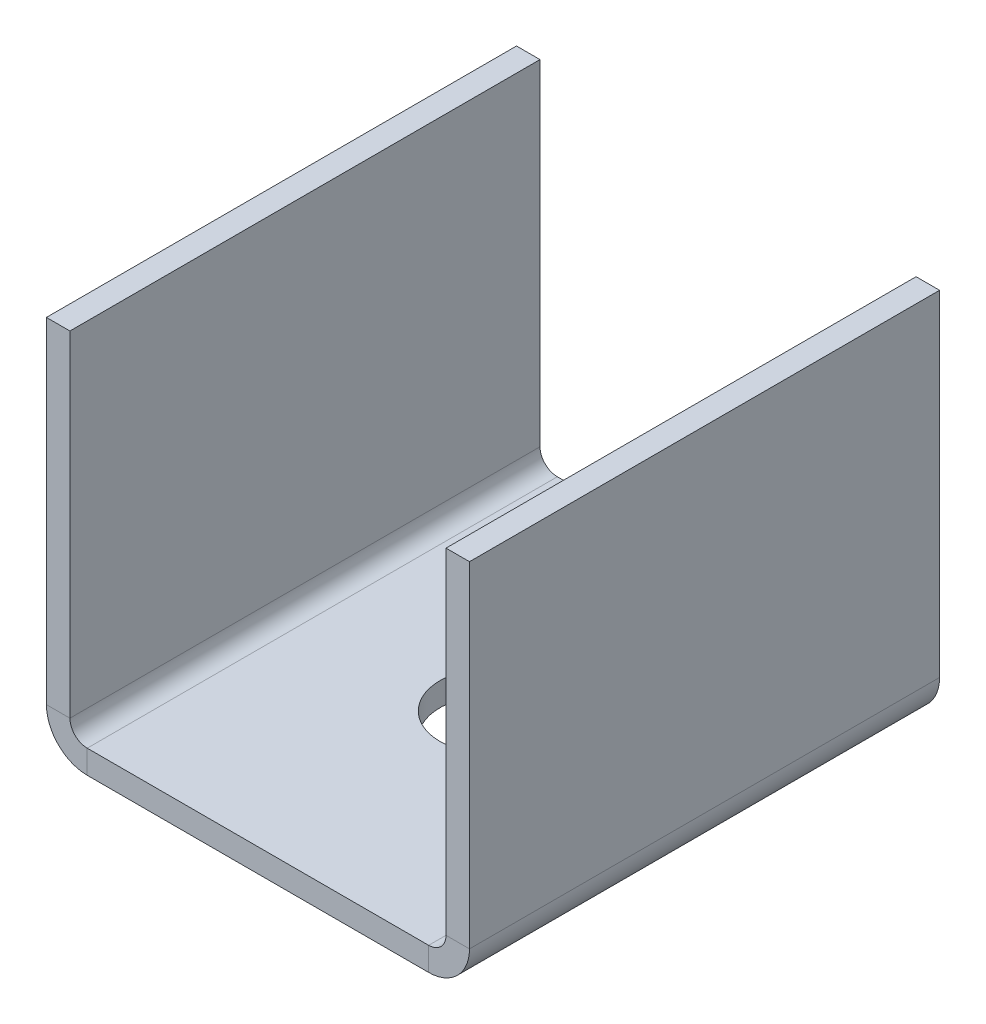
ISO-10303-21;
HEADER;
FILE_DESCRIPTION(('STEP AP214'),'2;1');
FILE_NAME('part.step','',(''),(''),'','','');
FILE_SCHEMA(('AUTOMOTIVE_DESIGN { 1 0 10303 214 1 1 1 1 }'));
ENDSEC;
DATA;
#1=APPLICATION_CONTEXT('core data for automotive mechanical design processes');
#2=APPLICATION_PROTOCOL_DEFINITION('international standard','automotive_design',2000,#1);
#3=PRODUCT_CONTEXT('',#1,'mechanical');
#4=PRODUCT('Part','Part','',(#3));
#5=PRODUCT_RELATED_PRODUCT_CATEGORY('part','',(#4));
#6=PRODUCT_DEFINITION_FORMATION('','',#4);
#7=PRODUCT_DEFINITION_CONTEXT('part definition',#1,'design');
#8=PRODUCT_DEFINITION('design','',#6,#7);
#9=PRODUCT_DEFINITION_SHAPE('','',#8);
#10=(LENGTH_UNIT() NAMED_UNIT(*) SI_UNIT(.MILLI.,.METRE.));
#11=(NAMED_UNIT(*) PLANE_ANGLE_UNIT() SI_UNIT($,.RADIAN.));
#12=(NAMED_UNIT(*) SI_UNIT($,.STERADIAN.) SOLID_ANGLE_UNIT());
#13=UNCERTAINTY_MEASURE_WITH_UNIT(LENGTH_MEASURE(1.E-05),#10,'distance_accuracy_value','');
#14=(GEOMETRIC_REPRESENTATION_CONTEXT(3) GLOBAL_UNCERTAINTY_ASSIGNED_CONTEXT((#13)) GLOBAL_UNIT_ASSIGNED_CONTEXT((#10,
#11,#12)) REPRESENTATION_CONTEXT('',''));
#15=CARTESIAN_POINT('',(0.,0.,0.));
#16=DIRECTION('',(0.,0.,1.));
#17=DIRECTION('',(1.,0.,0.));
#18=AXIS2_PLACEMENT_3D('',#15,#16,#17);
#19=CARTESIAN_POINT('',(33.0000000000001,-31.5268,-20.));
#20=DIRECTION('',(1.,0.,0.));
#21=DIRECTION('',(0.,0.,-1.));
#22=AXIS2_PLACEMENT_3D('',#19,#20,#21);
#23=PLANE('',#22);
#24=DIRECTION('',(0.,0.,1.));
#25=VECTOR('',#24,1.);
#26=CARTESIAN_POINT('',(32.9999999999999,16.0031999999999,-20.));
#27=LINE('',#26,#25);
#28=CARTESIAN_POINT('',(32.9999999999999,16.0031999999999,-20.));
#29=VERTEX_POINT('',#28);
#30=CARTESIAN_POINT('',(32.9999999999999,16.0031999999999,0.));
#31=VERTEX_POINT('',#30);
#32=EDGE_CURVE('E129',#29,#31,#27,.T.);
#33=ORIENTED_EDGE('',*,*,#32,.F.);
#34=DIRECTION('',(0.,-1.,0.));
#35=VECTOR('',#34,1.);
#36=CARTESIAN_POINT('',(33.0000000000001,-31.5268,-20.));
#37=LINE('',#36,#35);
#38=CARTESIAN_POINT('',(33.0000000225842,1.7366,-20.));
#39=VERTEX_POINT('',#38);
#40=EDGE_CURVE('E149',#29,#39,#37,.T.);
#41=ORIENTED_EDGE('',*,*,#40,.T.);
#42=DIRECTION('',(0.,0.,-1.));
#43=VECTOR('',#42,1.);
#44=CARTESIAN_POINT('',(33.,1.7366,-20.));
#45=LINE('',#44,#43);
#46=CARTESIAN_POINT('',(33.,1.7366,0.));
#47=VERTEX_POINT('',#46);
#48=EDGE_CURVE('E148',#47,#39,#45,.T.);
#49=ORIENTED_EDGE('',*,*,#48,.F.);
#50=DIRECTION('',(0.,1.,0.));
#51=VECTOR('',#50,1.);
#52=CARTESIAN_POINT('',(33.0000000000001,-31.5268,0.));
#53=LINE('',#52,#51);
#54=EDGE_CURVE('E143',#47,#31,#53,.T.);
#55=ORIENTED_EDGE('',*,*,#54,.T.);
#56=EDGE_LOOP('',(#33,#41,#49,#55));
#57=FACE_BOUND('',#56,.T.);
#58=ADVANCED_FACE('F40',(#57),#23,.F.);
#59=CARTESIAN_POINT('',(33.0000000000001,-31.5268,0.));
#60=DIRECTION('',(0.,0.,-1.));
#61=DIRECTION('',(0.,-1.,0.));
#62=AXIS2_PLACEMENT_3D('',#59,#60,#61);
#63=PLANE('',#62);
#64=DIRECTION('',(1.,0.,0.));
#65=VECTOR('',#64,1.);
#66=CARTESIAN_POINT('',(32.9999999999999,16.0031999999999,0.));
#67=LINE('',#66,#65);
#68=CARTESIAN_POINT('',(34.,16.0031999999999,0.));
#69=VERTEX_POINT('',#68);
#70=EDGE_CURVE('E132',#31,#69,#67,.T.);
#71=ORIENTED_EDGE('',*,*,#70,.F.);
#72=ORIENTED_EDGE('',*,*,#54,.F.);
#73=DIRECTION('',(-1.,0.,0.));
#74=VECTOR('',#73,1.);
#75=CARTESIAN_POINT('',(33.,1.7366,0.));
#76=LINE('',#75,#74);
#77=CARTESIAN_POINT('',(34.,1.73660000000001,0.));
#78=VERTEX_POINT('',#77);
#79=EDGE_CURVE('E150',#78,#47,#76,.T.);
#80=ORIENTED_EDGE('',*,*,#79,.F.);
#81=DIRECTION('',(0.,1.,0.));
#82=VECTOR('',#81,1.);
#83=CARTESIAN_POINT('',(34.0000000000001,-31.5268,0.));
#84=LINE('',#83,#82);
#85=EDGE_CURVE('E145',#78,#69,#84,.T.);
#86=ORIENTED_EDGE('',*,*,#85,.T.);
#87=EDGE_LOOP('',(#71,#72,#80,#86));
#88=FACE_BOUND('',#87,.T.);
#89=ADVANCED_FACE('F141',(#88),#63,.F.);
#90=CARTESIAN_POINT('',(34.0000000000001,-31.5268,-20.));
#91=DIRECTION('',(1.,0.,0.));
#92=DIRECTION('',(0.,0.,-1.));
#93=AXIS2_PLACEMENT_3D('',#90,#91,#92);
#94=PLANE('',#93);
#95=DIRECTION('',(0.,-1.,0.));
#96=VECTOR('',#95,1.);
#97=CARTESIAN_POINT('',(34.0000000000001,-31.5268,-20.));
#98=LINE('',#97,#96);
#99=CARTESIAN_POINT('',(34.,16.0031999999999,-20.));
#100=VERTEX_POINT('',#99);
#101=CARTESIAN_POINT('',(34.,1.73660000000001,-20.));
#102=VERTEX_POINT('',#101);
#103=EDGE_CURVE('E167',#100,#102,#98,.T.);
#104=ORIENTED_EDGE('',*,*,#103,.F.);
#105=DIRECTION('',(0.,0.,-1.));
#106=VECTOR('',#105,1.);
#107=CARTESIAN_POINT('',(34.,16.0031999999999,0.));
#108=LINE('',#107,#106);
#109=EDGE_CURVE('E57',#69,#100,#108,.T.);
#110=ORIENTED_EDGE('',*,*,#109,.F.);
#111=ORIENTED_EDGE('',*,*,#85,.F.);
#112=DIRECTION('',(0.,0.,-1.));
#113=VECTOR('',#112,1.);
#114=CARTESIAN_POINT('',(34.,1.73660000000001,-20.));
#115=LINE('',#114,#113);
#116=EDGE_CURVE('E255',#78,#102,#115,.T.);
#117=ORIENTED_EDGE('',*,*,#116,.T.);
#118=EDGE_LOOP('',(#104,#110,#111,#117));
#119=FACE_BOUND('',#118,.T.);
#120=ADVANCED_FACE('F319',(#119),#94,.T.);
#121=CARTESIAN_POINT('',(33.0000000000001,-31.5268,-20.));
#122=DIRECTION('',(0.,0.,1.));
#123=DIRECTION('',(0.,1.,0.));
#124=AXIS2_PLACEMENT_3D('',#121,#122,#123);
#125=PLANE('',#124);
#126=DIRECTION('',(-1.,0.,0.));
#127=VECTOR('',#126,1.);
#128=CARTESIAN_POINT('',(34.,16.0031999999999,-20.));
#129=LINE('',#128,#127);
#130=EDGE_CURVE('E133',#100,#29,#129,.T.);
#131=ORIENTED_EDGE('',*,*,#130,.F.);
#132=ORIENTED_EDGE('',*,*,#103,.T.);
#133=DIRECTION('',(1.,0.,0.));
#134=VECTOR('',#133,1.);
#135=CARTESIAN_POINT('',(33.,1.7366,-20.));
#136=LINE('',#135,#134);
#137=EDGE_CURVE('E153',#39,#102,#136,.T.);
#138=ORIENTED_EDGE('',*,*,#137,.F.);
#139=ORIENTED_EDGE('',*,*,#40,.F.);
#140=EDGE_LOOP('',(#131,#132,#138,#139));
#141=FACE_BOUND('',#140,.T.);
#142=ADVANCED_FACE('F326',(#141),#125,.F.);
#143=CARTESIAN_POINT('',(0.,1.,-20.));
#144=DIRECTION('',(0.,0.,1.));
#145=DIRECTION('',(1.,0.,0.));
#146=AXIS2_PLACEMENT_3D('',#143,#144,#145);
#147=PLANE('',#146);
#148=DIRECTION('',(-1.,0.,0.));
#149=VECTOR('',#148,1.);
#150=CARTESIAN_POINT('',(0.,1.,-20.));
#151=LINE('',#150,#149);
#152=CARTESIAN_POINT('',(32.2634,0.999999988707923,-20.));
#153=VERTEX_POINT('',#152);
#154=CARTESIAN_POINT('',(17.7366,1.,-20.));
#155=VERTEX_POINT('',#154);
#156=EDGE_CURVE('E217',#153,#155,#151,.T.);
#157=ORIENTED_EDGE('',*,*,#156,.F.);
#158=DIRECTION('',(0.,-1.,0.));
#159=VECTOR('',#158,1.);
#160=CARTESIAN_POINT('',(32.2634,1.,-20.));
#161=LINE('',#160,#159);
#162=CARTESIAN_POINT('',(32.2634,0.,-20.));
#163=VERTEX_POINT('',#162);
#164=EDGE_CURVE('E12',#153,#163,#161,.T.);
#165=ORIENTED_EDGE('',*,*,#164,.T.);
#166=DIRECTION('',(-1.,0.,0.));
#167=VECTOR('',#166,1.);
#168=CARTESIAN_POINT('',(0.,0.,-20.));
#169=LINE('',#168,#167);
#170=CARTESIAN_POINT('',(17.7366,0.,-20.));
#171=VERTEX_POINT('',#170);
#172=EDGE_CURVE('E233',#163,#171,#169,.T.);
#173=ORIENTED_EDGE('',*,*,#172,.T.);
#174=DIRECTION('',(0.,-1.,0.));
#175=VECTOR('',#174,1.);
#176=CARTESIAN_POINT('',(17.7366,1.,-20.));
#177=LINE('',#176,#175);
#178=EDGE_CURVE('E216',#155,#171,#177,.T.);
#179=ORIENTED_EDGE('',*,*,#178,.F.);
#180=EDGE_LOOP('',(#157,#165,#173,#179));
#181=FACE_BOUND('',#180,.T.);
#182=ADVANCED_FACE('F42',(#181),#147,.F.);
#183=CARTESIAN_POINT('',(0.,1.,0.));
#184=DIRECTION('',(0.,0.,-1.));
#185=DIRECTION('',(-1.,0.,0.));
#186=AXIS2_PLACEMENT_3D('',#183,#184,#185);
#187=PLANE('',#186);
#188=DIRECTION('',(1.,0.,0.));
#189=VECTOR('',#188,1.);
#190=CARTESIAN_POINT('',(0.,0.,0.));
#191=LINE('',#190,#189);
#192=CARTESIAN_POINT('',(17.7366,0.,0.));
#193=VERTEX_POINT('',#192);
#194=CARTESIAN_POINT('',(32.2634,-2.25841554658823E-08,0.));
#195=VERTEX_POINT('',#194);
#196=EDGE_CURVE('E212',#193,#195,#191,.T.);
#197=ORIENTED_EDGE('',*,*,#196,.T.);
#198=DIRECTION('',(0.,1.,0.));
#199=VECTOR('',#198,1.);
#200=CARTESIAN_POINT('',(32.2634,1.,0.));
#201=LINE('',#200,#199);
#202=CARTESIAN_POINT('',(32.2634,0.999999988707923,0.));
#203=VERTEX_POINT('',#202);
#204=EDGE_CURVE('E229',#195,#203,#201,.T.);
#205=ORIENTED_EDGE('',*,*,#204,.T.);
#206=DIRECTION('',(1.,0.,0.));
#207=VECTOR('',#206,1.);
#208=CARTESIAN_POINT('',(0.,1.,0.));
#209=LINE('',#208,#207);
#210=CARTESIAN_POINT('',(17.7366,1.00000000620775,0.));
#211=VERTEX_POINT('',#210);
#212=EDGE_CURVE('E44',#211,#203,#209,.T.);
#213=ORIENTED_EDGE('',*,*,#212,.F.);
#214=DIRECTION('',(0.,1.,0.));
#215=VECTOR('',#214,1.);
#216=CARTESIAN_POINT('',(17.7366,1.,0.));
#217=LINE('',#216,#215);
#218=EDGE_CURVE('E223',#193,#211,#217,.T.);
#219=ORIENTED_EDGE('',*,*,#218,.F.);
#220=EDGE_LOOP('',(#197,#205,#213,#219));
#221=FACE_BOUND('',#220,.T.);
#222=ADVANCED_FACE('F245',(#221),#187,.F.);
#223=CARTESIAN_POINT('',(0.,1.,-20.));
#224=DIRECTION('',(0.,-1.,0.));
#225=DIRECTION('',(0.,0.,-1.));
#226=AXIS2_PLACEMENT_3D('',#223,#224,#225);
#227=PLANE('',#226);
#228=CARTESIAN_POINT('',(25.,1.,-10.));
#229=DIRECTION('',(0.,1.,0.));
#230=DIRECTION('',(0.,0.,1.));
#231=AXIS2_PLACEMENT_3D('',#228,#229,#230);
#232=CIRCLE('',#231,2.25);
#233=CARTESIAN_POINT('',(25.,1.,-7.75000000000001));
#234=VERTEX_POINT('',#233);
#235=EDGE_CURVE('E209',#234,#234,#232,.T.);
#236=ORIENTED_EDGE('',*,*,#235,.F.);
#237=EDGE_LOOP('',(#236));
#238=FACE_BOUND('',#237,.T.);
#239=ORIENTED_EDGE('',*,*,#212,.T.);
#240=DIRECTION('',(0.,0.,-1.));
#241=VECTOR('',#240,1.);
#242=CARTESIAN_POINT('',(32.2634,1.,-20.));
#243=LINE('',#242,#241);
#244=EDGE_CURVE('E226',#203,#153,#243,.T.);
#245=ORIENTED_EDGE('',*,*,#244,.T.);
#246=ORIENTED_EDGE('',*,*,#156,.T.);
#247=DIRECTION('',(0.,0.,-1.));
#248=VECTOR('',#247,1.);
#249=CARTESIAN_POINT('',(17.7366,1.,-20.));
#250=LINE('',#249,#248);
#251=EDGE_CURVE('E213',#211,#155,#250,.T.);
#252=ORIENTED_EDGE('',*,*,#251,.F.);
#253=EDGE_LOOP('',(#239,#245,#246,#252));
#254=FACE_BOUND('',#253,.T.);
#255=ADVANCED_FACE('F241',(#238,#254),#227,.F.);
#256=CARTESIAN_POINT('',(0.,0.,-20.));
#257=DIRECTION('',(0.,-1.,0.));
#258=DIRECTION('',(0.,0.,-1.));
#259=AXIS2_PLACEMENT_3D('',#256,#257,#258);
#260=PLANE('',#259);
#261=DIRECTION('',(0.,0.,-1.));
#262=VECTOR('',#261,1.);
#263=CARTESIAN_POINT('',(32.2634,0.,-20.));
#264=LINE('',#263,#262);
#265=EDGE_CURVE('E49',#195,#163,#264,.T.);
#266=ORIENTED_EDGE('',*,*,#265,.F.);
#267=ORIENTED_EDGE('',*,*,#196,.F.);
#268=DIRECTION('',(0.,0.,-1.));
#269=VECTOR('',#268,1.);
#270=CARTESIAN_POINT('',(17.7366,0.,-20.));
#271=LINE('',#270,#269);
#272=EDGE_CURVE('E220',#193,#171,#271,.T.);
#273=ORIENTED_EDGE('',*,*,#272,.T.);
#274=ORIENTED_EDGE('',*,*,#172,.F.);
#275=EDGE_LOOP('',(#266,#267,#273,#274));
#276=FACE_BOUND('',#275,.T.);
#277=CARTESIAN_POINT('',(25.,0.,-10.));
#278=DIRECTION('',(0.,1.,0.));
#279=DIRECTION('',(0.,0.,1.));
#280=AXIS2_PLACEMENT_3D('',#277,#278,#279);
#281=CIRCLE('',#280,2.25);
#282=CARTESIAN_POINT('',(25.,0.,-7.75000000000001));
#283=VERTEX_POINT('',#282);
#284=EDGE_CURVE('E206',#283,#283,#281,.T.);
#285=ORIENTED_EDGE('',*,*,#284,.T.);
#286=EDGE_LOOP('',(#285));
#287=FACE_BOUND('',#286,.T.);
#288=ADVANCED_FACE('F295',(#276,#287),#260,.T.);
#289=CARTESIAN_POINT('',(25.,1.,-10.));
#290=DIRECTION('',(0.,-1.,0.));
#291=DIRECTION('',(0.,0.,-1.));
#292=AXIS2_PLACEMENT_3D('',#289,#290,#291);
#293=CYLINDRICAL_SURFACE('',#292,2.25);
#294=ORIENTED_EDGE('',*,*,#235,.T.);
#295=EDGE_LOOP('',(#294));
#296=FACE_BOUND('',#295,.T.);
#297=ORIENTED_EDGE('',*,*,#284,.F.);
#298=EDGE_LOOP('',(#297));
#299=FACE_BOUND('',#298,.T.);
#300=ADVANCED_FACE('F344',(#296,#299),#293,.F.);
#301=CARTESIAN_POINT('',(17.7366,1.7365999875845,0.));
#302=DIRECTION('',(0.,0.,-1.));
#303=DIRECTION('',(-1.,0.,0.));
#304=AXIS2_PLACEMENT_3D('',#301,#302,#303);
#305=PLANE('',#304);
#306=DIRECTION('',(1.,0.,0.));
#307=VECTOR('',#306,1.);
#308=CARTESIAN_POINT('',(17.,1.7366,0.));
#309=LINE('',#308,#307);
#310=CARTESIAN_POINT('',(16.,1.7366,0.));
#311=VERTEX_POINT('',#310);
#312=CARTESIAN_POINT('',(17.0000000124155,1.7366,0.));
#313=VERTEX_POINT('',#312);
#314=EDGE_CURVE('E174',#311,#313,#309,.T.);
#315=ORIENTED_EDGE('',*,*,#314,.F.);
#316=CARTESIAN_POINT('',(17.7366,1.7366,0.));
#317=DIRECTION('',(0.,0.,1.));
#318=DIRECTION('',(1.,0.,0.));
#319=AXIS2_PLACEMENT_3D('',#316,#317,#318);
#320=CIRCLE('',#319,1.7365999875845);
#321=EDGE_CURVE('E177',#311,#193,#320,.T.);
#322=ORIENTED_EDGE('',*,*,#321,.T.);
#323=ORIENTED_EDGE('',*,*,#218,.T.);
#324=CARTESIAN_POINT('',(17.7366,1.7365999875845,0.));
#325=DIRECTION('',(0.,0.,1.));
#326=DIRECTION('',(1.,0.,0.));
#327=AXIS2_PLACEMENT_3D('',#324,#325,#326);
#328=CIRCLE('',#327,0.736599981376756);
#329=EDGE_CURVE('E200',#313,#211,#328,.T.);
#330=ORIENTED_EDGE('',*,*,#329,.F.);
#331=EDGE_LOOP('',(#315,#322,#323,#330));
#332=FACE_BOUND('',#331,.T.);
#333=ADVANCED_FACE('F288',(#332),#305,.F.);
#334=CARTESIAN_POINT('',(17.7366,1.7365999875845,-20.));
#335=DIRECTION('',(0.,0.,1.));
#336=DIRECTION('',(1.,0.,0.));
#337=AXIS2_PLACEMENT_3D('',#334,#335,#336);
#338=PLANE('',#337);
#339=CARTESIAN_POINT('',(17.7366,1.7366,-20.));
#340=DIRECTION('',(0.,0.,1.));
#341=DIRECTION('',(1.,0.,0.));
#342=AXIS2_PLACEMENT_3D('',#339,#340,#341);
#343=CIRCLE('',#342,1.7365999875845);
#344=CARTESIAN_POINT('',(16.,1.7366,-20.));
#345=VERTEX_POINT('',#344);
#346=EDGE_CURVE('E197',#171,#345,#343,.F.);
#347=ORIENTED_EDGE('',*,*,#346,.T.);
#348=DIRECTION('',(-1.,0.,0.));
#349=VECTOR('',#348,1.);
#350=CARTESIAN_POINT('',(17.,1.7366,-20.));
#351=LINE('',#350,#349);
#352=CARTESIAN_POINT('',(17.,1.7366,-20.));
#353=VERTEX_POINT('',#352);
#354=EDGE_CURVE('E183',#353,#345,#351,.T.);
#355=ORIENTED_EDGE('',*,*,#354,.F.);
#356=CARTESIAN_POINT('',(17.7366,1.7365999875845,-20.));
#357=DIRECTION('',(0.,0.,-1.));
#358=DIRECTION('',(-1.,0.,0.));
#359=AXIS2_PLACEMENT_3D('',#356,#357,#358);
#360=CIRCLE('',#359,0.736599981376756);
#361=EDGE_CURVE('E203',#155,#353,#360,.T.);
#362=ORIENTED_EDGE('',*,*,#361,.F.);
#363=ORIENTED_EDGE('',*,*,#178,.T.);
#364=EDGE_LOOP('',(#347,#355,#362,#363));
#365=FACE_BOUND('',#364,.T.);
#366=ADVANCED_FACE('F298',(#365),#338,.F.);
#367=CARTESIAN_POINT('',(17.7366,1.7366,-30.0499376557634));
#368=DIRECTION('',(0.,0.,1.));
#369=DIRECTION('',(1.,0.,0.));
#370=AXIS2_PLACEMENT_3D('',#367,#368,#369);
#371=CYLINDRICAL_SURFACE('',#370,0.736599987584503);
#372=ORIENTED_EDGE('',*,*,#251,.T.);
#373=ORIENTED_EDGE('',*,*,#361,.T.);
#374=DIRECTION('',(0.,0.,-1.));
#375=VECTOR('',#374,1.);
#376=CARTESIAN_POINT('',(17.,1.7366,-20.));
#377=LINE('',#376,#375);
#378=EDGE_CURVE('E189',#313,#353,#377,.T.);
#379=ORIENTED_EDGE('',*,*,#378,.F.);
#380=ORIENTED_EDGE('',*,*,#329,.T.);
#381=EDGE_LOOP('',(#372,#373,#379,#380));
#382=FACE_BOUND('',#381,.T.);
#383=ADVANCED_FACE('F286',(#382),#371,.F.);
#384=CARTESIAN_POINT('',(17.7366,1.7366,-30.0499376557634));
#385=DIRECTION('',(0.,0.,1.));
#386=DIRECTION('',(1.,0.,0.));
#387=AXIS2_PLACEMENT_3D('',#384,#385,#386);
#388=CYLINDRICAL_SURFACE('',#387,1.7365999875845);
#389=ORIENTED_EDGE('',*,*,#272,.F.);
#390=ORIENTED_EDGE('',*,*,#321,.F.);
#391=DIRECTION('',(0.,0.,-1.));
#392=VECTOR('',#391,1.);
#393=CARTESIAN_POINT('',(16.,1.7366,-20.));
#394=LINE('',#393,#392);
#395=EDGE_CURVE('E173',#311,#345,#394,.T.);
#396=ORIENTED_EDGE('',*,*,#395,.T.);
#397=ORIENTED_EDGE('',*,*,#346,.F.);
#398=EDGE_LOOP('',(#389,#390,#396,#397));
#399=FACE_BOUND('',#398,.T.);
#400=ADVANCED_FACE('F292',(#399),#388,.T.);
#401=CARTESIAN_POINT('',(17.0000000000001,18.4732,-20.));
#402=DIRECTION('',(-1.,0.,0.));
#403=DIRECTION('',(0.,0.,-1.));
#404=AXIS2_PLACEMENT_3D('',#401,#402,#403);
#405=PLANE('',#404);
#406=DIRECTION('',(0.,1.,0.));
#407=VECTOR('',#406,1.);
#408=CARTESIAN_POINT('',(17.0000000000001,18.4732,-20.));
#409=LINE('',#408,#407);
#410=CARTESIAN_POINT('',(17.,16.0032,-20.));
#411=VERTEX_POINT('',#410);
#412=EDGE_CURVE('E186',#353,#411,#409,.T.);
#413=ORIENTED_EDGE('',*,*,#412,.T.);
#414=DIRECTION('',(0.,0.,-1.));
#415=VECTOR('',#414,1.);
#416=CARTESIAN_POINT('',(17.,16.0032,-20.));
#417=LINE('',#416,#415);
#418=CARTESIAN_POINT('',(17.,16.0032,0.));
#419=VERTEX_POINT('',#418);
#420=EDGE_CURVE('E264',#419,#411,#417,.T.);
#421=ORIENTED_EDGE('',*,*,#420,.F.);
#422=DIRECTION('',(0.,-1.,0.));
#423=VECTOR('',#422,1.);
#424=CARTESIAN_POINT('',(17.0000000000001,18.4732,0.));
#425=LINE('',#424,#423);
#426=EDGE_CURVE('E191',#419,#313,#425,.T.);
#427=ORIENTED_EDGE('',*,*,#426,.T.);
#428=ORIENTED_EDGE('',*,*,#378,.T.);
#429=EDGE_LOOP('',(#413,#421,#427,#428));
#430=FACE_BOUND('',#429,.T.);
#431=ADVANCED_FACE('F276',(#430),#405,.F.);
#432=CARTESIAN_POINT('',(17.0000000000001,18.4732,-20.));
#433=DIRECTION('',(0.,0.,1.));
#434=DIRECTION('',(0.,-1.,0.));
#435=AXIS2_PLACEMENT_3D('',#432,#433,#434);
#436=PLANE('',#435);
#437=DIRECTION('',(0.,1.,0.));
#438=VECTOR('',#437,1.);
#439=CARTESIAN_POINT('',(16.0000000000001,18.4732,-20.));
#440=LINE('',#439,#438);
#441=CARTESIAN_POINT('',(16.,16.0032,-20.));
#442=VERTEX_POINT('',#441);
#443=EDGE_CURVE('E180',#345,#442,#440,.T.);
#444=ORIENTED_EDGE('',*,*,#443,.T.);
#445=DIRECTION('',(-1.,0.,0.));
#446=VECTOR('',#445,1.);
#447=CARTESIAN_POINT('',(16.,16.0032,-20.));
#448=LINE('',#447,#446);
#449=EDGE_CURVE('E262',#411,#442,#448,.T.);
#450=ORIENTED_EDGE('',*,*,#449,.F.);
#451=ORIENTED_EDGE('',*,*,#412,.F.);
#452=ORIENTED_EDGE('',*,*,#354,.T.);
#453=EDGE_LOOP('',(#444,#450,#451,#452));
#454=FACE_BOUND('',#453,.T.);
#455=ADVANCED_FACE('F366',(#454),#436,.F.);
#456=CARTESIAN_POINT('',(16.0000000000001,18.4732,-20.));
#457=DIRECTION('',(-1.,0.,0.));
#458=DIRECTION('',(0.,0.,-1.));
#459=AXIS2_PLACEMENT_3D('',#456,#457,#458);
#460=PLANE('',#459);
#461=DIRECTION('',(0.,0.,1.));
#462=VECTOR('',#461,1.);
#463=CARTESIAN_POINT('',(16.,16.0032,0.));
#464=LINE('',#463,#462);
#465=CARTESIAN_POINT('',(16.,16.0032,0.));
#466=VERTEX_POINT('',#465);
#467=EDGE_CURVE('E65',#442,#466,#464,.T.);
#468=ORIENTED_EDGE('',*,*,#467,.F.);
#469=ORIENTED_EDGE('',*,*,#443,.F.);
#470=ORIENTED_EDGE('',*,*,#395,.F.);
#471=DIRECTION('',(0.,-1.,0.));
#472=VECTOR('',#471,1.);
#473=CARTESIAN_POINT('',(16.0000000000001,18.4732,0.));
#474=LINE('',#473,#472);
#475=EDGE_CURVE('E178',#466,#311,#474,.T.);
#476=ORIENTED_EDGE('',*,*,#475,.F.);
#477=EDGE_LOOP('',(#468,#469,#470,#476));
#478=FACE_BOUND('',#477,.T.);
#479=ADVANCED_FACE('F363',(#478),#460,.T.);
#480=CARTESIAN_POINT('',(17.0000000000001,18.4732,0.));
#481=DIRECTION('',(0.,0.,-1.));
#482=DIRECTION('',(0.,1.,0.));
#483=AXIS2_PLACEMENT_3D('',#480,#481,#482);
#484=PLANE('',#483);
#485=ORIENTED_EDGE('',*,*,#426,.F.);
#486=DIRECTION('',(1.,0.,0.));
#487=VECTOR('',#486,1.);
#488=CARTESIAN_POINT('',(17.,16.0032,0.));
#489=LINE('',#488,#487);
#490=EDGE_CURVE('E266',#466,#419,#489,.T.);
#491=ORIENTED_EDGE('',*,*,#490,.F.);
#492=ORIENTED_EDGE('',*,*,#475,.T.);
#493=ORIENTED_EDGE('',*,*,#314,.T.);
#494=EDGE_LOOP('',(#485,#491,#492,#493));
#495=FACE_BOUND('',#494,.T.);
#496=ADVANCED_FACE('F278',(#495),#484,.F.);
#497=CARTESIAN_POINT('',(32.2634,1.73660002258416,0.));
#498=DIRECTION('',(0.,0.,-1.));
#499=DIRECTION('',(-1.,0.,0.));
#500=AXIS2_PLACEMENT_3D('',#497,#498,#499);
#501=PLANE('',#500);
#502=ORIENTED_EDGE('',*,*,#204,.F.);
#503=CARTESIAN_POINT('',(32.2634,1.7366,0.));
#504=DIRECTION('',(0.,0.,-1.));
#505=DIRECTION('',(-1.,0.,0.));
#506=AXIS2_PLACEMENT_3D('',#503,#504,#505);
#507=CIRCLE('',#506,1.73660002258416);
#508=EDGE_CURVE('E164',#195,#78,#507,.F.);
#509=ORIENTED_EDGE('',*,*,#508,.T.);
#510=ORIENTED_EDGE('',*,*,#79,.T.);
#511=CARTESIAN_POINT('',(32.2634,1.73660002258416,0.));
#512=DIRECTION('',(0.,0.,1.));
#513=DIRECTION('',(1.,0.,0.));
#514=AXIS2_PLACEMENT_3D('',#511,#512,#513);
#515=CIRCLE('',#514,0.736600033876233);
#516=EDGE_CURVE('E163',#203,#47,#515,.T.);
#517=ORIENTED_EDGE('',*,*,#516,.F.);
#518=EDGE_LOOP('',(#502,#509,#510,#517));
#519=FACE_BOUND('',#518,.T.);
#520=ADVANCED_FACE('F249',(#519),#501,.F.);
#521=CARTESIAN_POINT('',(32.2634,1.73660002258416,-20.));
#522=DIRECTION('',(0.,0.,1.));
#523=DIRECTION('',(1.,0.,0.));
#524=AXIS2_PLACEMENT_3D('',#521,#522,#523);
#525=PLANE('',#524);
#526=ORIENTED_EDGE('',*,*,#137,.T.);
#527=CARTESIAN_POINT('',(32.2634,1.7366,-20.));
#528=DIRECTION('',(0.,0.,-1.));
#529=DIRECTION('',(-1.,0.,0.));
#530=AXIS2_PLACEMENT_3D('',#527,#528,#529);
#531=CIRCLE('',#530,1.73660002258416);
#532=EDGE_CURVE('E160',#102,#163,#531,.T.);
#533=ORIENTED_EDGE('',*,*,#532,.T.);
#534=ORIENTED_EDGE('',*,*,#164,.F.);
#535=CARTESIAN_POINT('',(32.2634,1.73660002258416,-20.));
#536=DIRECTION('',(0.,0.,-1.));
#537=DIRECTION('',(-1.,0.,0.));
#538=AXIS2_PLACEMENT_3D('',#535,#536,#537);
#539=CIRCLE('',#538,0.736600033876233);
#540=EDGE_CURVE('E170',#39,#153,#539,.T.);
#541=ORIENTED_EDGE('',*,*,#540,.F.);
#542=EDGE_LOOP('',(#526,#533,#534,#541));
#543=FACE_BOUND('',#542,.T.);
#544=ADVANCED_FACE('F303',(#543),#525,.F.);
#545=CARTESIAN_POINT('',(32.2634,1.7366,10.0499376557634));
#546=DIRECTION('',(0.,0.,-1.));
#547=DIRECTION('',(-1.,0.,0.));
#548=AXIS2_PLACEMENT_3D('',#545,#546,#547);
#549=CYLINDRICAL_SURFACE('',#548,0.736600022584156);
#550=ORIENTED_EDGE('',*,*,#540,.T.);
#551=ORIENTED_EDGE('',*,*,#244,.F.);
#552=ORIENTED_EDGE('',*,*,#516,.T.);
#553=ORIENTED_EDGE('',*,*,#48,.T.);
#554=EDGE_LOOP('',(#550,#551,#552,#553));
#555=FACE_BOUND('',#554,.T.);
#556=ADVANCED_FACE('F305',(#555),#549,.F.);
#557=CARTESIAN_POINT('',(32.2634,1.7366,10.0499376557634));
#558=DIRECTION('',(0.,0.,-1.));
#559=DIRECTION('',(-1.,0.,0.));
#560=AXIS2_PLACEMENT_3D('',#557,#558,#559);
#561=CYLINDRICAL_SURFACE('',#560,1.73660002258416);
#562=ORIENTED_EDGE('',*,*,#532,.F.);
#563=ORIENTED_EDGE('',*,*,#116,.F.);
#564=ORIENTED_EDGE('',*,*,#508,.F.);
#565=ORIENTED_EDGE('',*,*,#265,.T.);
#566=EDGE_LOOP('',(#562,#563,#564,#565));
#567=FACE_BOUND('',#566,.T.);
#568=ADVANCED_FACE('F253',(#567),#561,.T.);
#569=CARTESIAN_POINT('',(16.,16.0032,0.));
#570=DIRECTION('',(0.,-1.,0.));
#571=DIRECTION('',(1.,0.,0.));
#572=AXIS2_PLACEMENT_3D('',#569,#570,#571);
#573=PLANE('',#572);
#574=ORIENTED_EDGE('',*,*,#490,.T.);
#575=ORIENTED_EDGE('',*,*,#420,.T.);
#576=ORIENTED_EDGE('',*,*,#449,.T.);
#577=ORIENTED_EDGE('',*,*,#467,.T.);
#578=EDGE_LOOP('',(#574,#575,#576,#577));
#579=FACE_BOUND('',#578,.T.);
#580=ADVANCED_FACE('F270',(#579),#573,.F.);
#581=CARTESIAN_POINT('',(32.9999999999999,16.0031999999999,0.));
#582=DIRECTION('',(0.,1.,0.));
#583=DIRECTION('',(-1.,0.,0.));
#584=AXIS2_PLACEMENT_3D('',#581,#582,#583);
#585=PLANE('',#584);
#586=ORIENTED_EDGE('',*,*,#32,.T.);
#587=ORIENTED_EDGE('',*,*,#70,.T.);
#588=ORIENTED_EDGE('',*,*,#109,.T.);
#589=ORIENTED_EDGE('',*,*,#130,.T.);
#590=EDGE_LOOP('',(#586,#587,#588,#589));
#591=FACE_BOUND('',#590,.T.);
#592=ADVANCED_FACE('F131',(#591),#585,.T.);
#593=CLOSED_SHELL('',(#58,#89,#120,#142,#182,#222,#255,#288,#300,#333,#366,#383,#400,#431,#455,
#479,#496,#520,#544,#556,#568,#580,#592));
#594=MANIFOLD_SOLID_BREP('B2',#593);
#595=ADVANCED_BREP_SHAPE_REPRESENTATION('',(#18,#594),#14);
#596=SHAPE_DEFINITION_REPRESENTATION(#9,#595);
ENDSEC;
END-ISO-10303-21;
